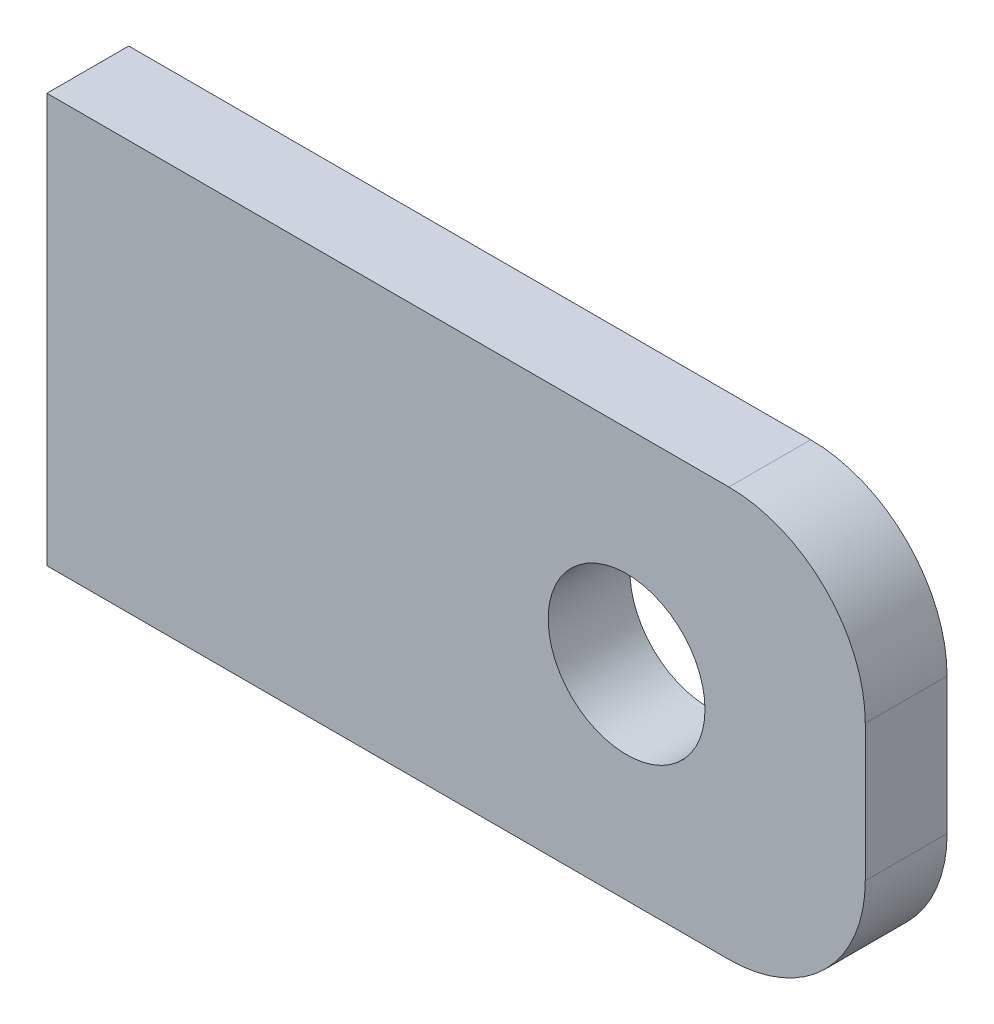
from build123d import *

# Parameters (mm, degrees)
ESQUISSE1_R          = 11.5
BASE_EXTRUSION_DEPTH = 12


with BuildPart() as part:
    # Esquisse1 → Base-Extrusion (new body)
    with BuildSketch(Plane.XY):
        with BuildLine():
            Line((0, 0), (100, 0))
            ThreePointArc((100, 0), (114.142135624, -5.857864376), (120, -20))
            Line((120, -20), (120, -40))
            ThreePointArc((120, -40), (114.142135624, -54.142135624), (100, -60))
            Line((100, -60), (0, -60))
            Line((0, -60), (0, 0))
        make_face()
        with Locations((85, -30)):
            Circle(ESQUISSE1_R, mode=Mode.SUBTRACT)
    extrude(amount=BASE_EXTRUSION_DEPTH)


solid = part.part
